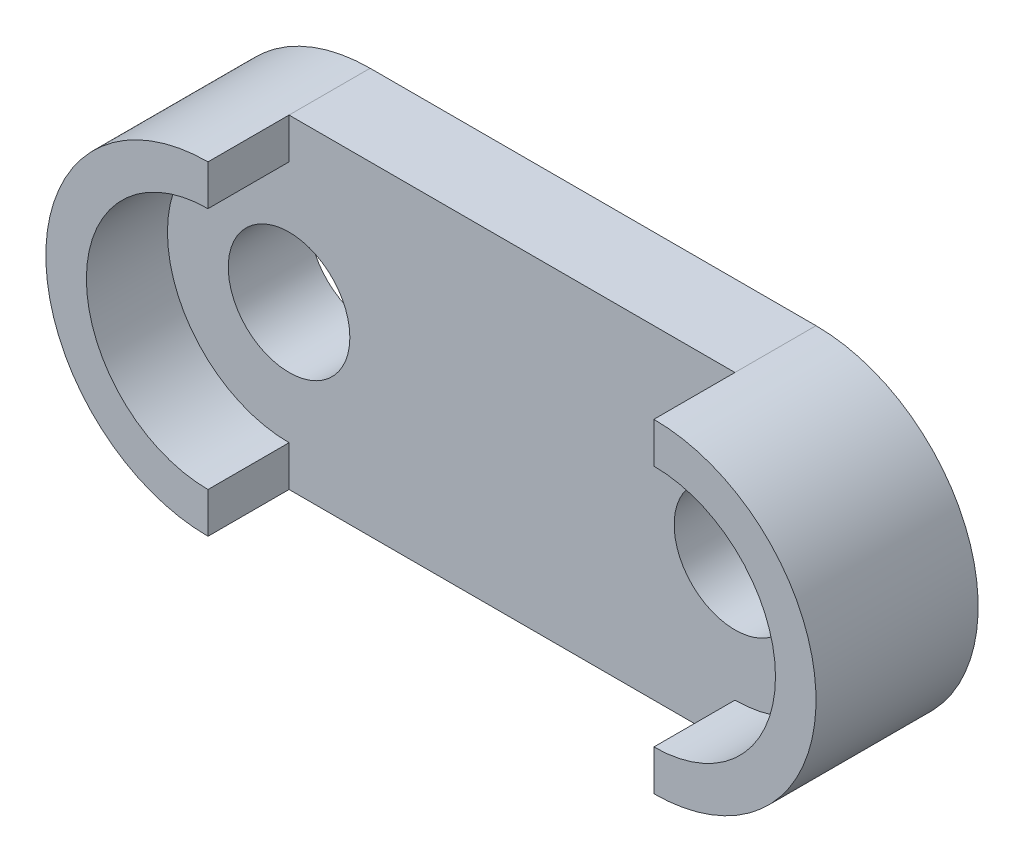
ISO-10303-21;
HEADER;
FILE_DESCRIPTION(('STEP AP214'),'2;1');
FILE_NAME('part.step','',(''),(''),'','','');
FILE_SCHEMA(('AUTOMOTIVE_DESIGN { 1 0 10303 214 1 1 1 1 }'));
ENDSEC;
DATA;
#1=APPLICATION_CONTEXT('core data for automotive mechanical design processes');
#2=APPLICATION_PROTOCOL_DEFINITION('international standard','automotive_design',2000,#1);
#3=PRODUCT_CONTEXT('',#1,'mechanical');
#4=PRODUCT('Part','Part','',(#3));
#5=PRODUCT_RELATED_PRODUCT_CATEGORY('part','',(#4));
#6=PRODUCT_DEFINITION_FORMATION('','',#4);
#7=PRODUCT_DEFINITION_CONTEXT('part definition',#1,'design');
#8=PRODUCT_DEFINITION('design','',#6,#7);
#9=PRODUCT_DEFINITION_SHAPE('','',#8);
#10=(LENGTH_UNIT() NAMED_UNIT(*) SI_UNIT(.MILLI.,.METRE.));
#11=(NAMED_UNIT(*) PLANE_ANGLE_UNIT() SI_UNIT($,.RADIAN.));
#12=(NAMED_UNIT(*) SI_UNIT($,.STERADIAN.) SOLID_ANGLE_UNIT());
#13=UNCERTAINTY_MEASURE_WITH_UNIT(LENGTH_MEASURE(1.E-05),#10,'distance_accuracy_value','');
#14=(GEOMETRIC_REPRESENTATION_CONTEXT(3) GLOBAL_UNCERTAINTY_ASSIGNED_CONTEXT((#13)) GLOBAL_UNIT_ASSIGNED_CONTEXT((#10,
#11,#12)) REPRESENTATION_CONTEXT('',''));
#15=CARTESIAN_POINT('',(0.,0.,0.));
#16=DIRECTION('',(0.,0.,1.));
#17=DIRECTION('',(1.,0.,0.));
#18=AXIS2_PLACEMENT_3D('',#15,#16,#17);
#19=CARTESIAN_POINT('',(-5.50000000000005,0.,1.));
#20=DIRECTION('',(0.,0.,1.));
#21=DIRECTION('',(1.,0.,0.));
#22=AXIS2_PLACEMENT_3D('',#19,#20,#21);
#23=PLANE('',#22);
#24=CARTESIAN_POINT('',(5.50000000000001,0.,0.999999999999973));
#25=DIRECTION('',(0.,0.,1.));
#26=DIRECTION('',(1.,0.,0.));
#27=AXIS2_PLACEMENT_3D('',#24,#25,#26);
#28=CIRCLE('',#27,1.5);
#29=CARTESIAN_POINT('',(7.00000000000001,0.,0.999999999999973));
#30=VERTEX_POINT('',#29);
#31=EDGE_CURVE('E174',#30,#30,#28,.T.);
#32=ORIENTED_EDGE('',*,*,#31,.F.);
#33=EDGE_LOOP('',(#32));
#34=FACE_BOUND('',#33,.T.);
#35=CARTESIAN_POINT('',(-5.50000000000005,0.,1.));
#36=DIRECTION('',(0.,0.,1.));
#37=DIRECTION('',(1.,0.,0.));
#38=AXIS2_PLACEMENT_3D('',#35,#36,#37);
#39=CIRCLE('',#38,1.5);
#40=CARTESIAN_POINT('',(-4.00000000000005,0.,1.));
#41=VERTEX_POINT('',#40);
#42=EDGE_CURVE('E168',#41,#41,#39,.T.);
#43=ORIENTED_EDGE('',*,*,#42,.F.);
#44=EDGE_LOOP('',(#43));
#45=FACE_BOUND('',#44,.T.);
#46=CARTESIAN_POINT('',(-5.50000000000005,0.,1.));
#47=DIRECTION('',(0.,0.,-1.));
#48=DIRECTION('',(-1.,0.,0.));
#49=AXIS2_PLACEMENT_3D('',#46,#47,#48);
#50=CIRCLE('',#49,3.);
#51=CARTESIAN_POINT('',(-5.50000000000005,-3.00000000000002,1.00000000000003));
#52=VERTEX_POINT('',#51);
#53=CARTESIAN_POINT('',(-5.50000000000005,3.,1.));
#54=VERTEX_POINT('',#53);
#55=EDGE_CURVE('E46',#52,#54,#50,.T.);
#56=ORIENTED_EDGE('',*,*,#55,.F.);
#57=DIRECTION('',(0.,1.,0.));
#58=VECTOR('',#57,1.);
#59=CARTESIAN_POINT('',(-5.50000000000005,-4.00000000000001,1.00000000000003));
#60=LINE('',#59,#58);
#61=CARTESIAN_POINT('',(-5.50000000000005,-4.00000000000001,1.00000000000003));
#62=VERTEX_POINT('',#61);
#63=EDGE_CURVE('E124',#62,#52,#60,.T.);
#64=ORIENTED_EDGE('',*,*,#63,.F.);
#65=DIRECTION('',(1.,0.,0.));
#66=VECTOR('',#65,1.);
#67=CARTESIAN_POINT('',(-5.50000000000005,-4.00000000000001,1.00000000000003));
#68=LINE('',#67,#66);
#69=CARTESIAN_POINT('',(5.50000000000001,-4.00000000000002,1.));
#70=VERTEX_POINT('',#69);
#71=EDGE_CURVE('E117',#62,#70,#68,.T.);
#72=ORIENTED_EDGE('',*,*,#71,.T.);
#73=DIRECTION('',(0.,1.,0.));
#74=VECTOR('',#73,1.);
#75=CARTESIAN_POINT('',(5.50000000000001,-4.00000000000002,1.));
#76=LINE('',#75,#74);
#77=CARTESIAN_POINT('',(5.50000000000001,-3.,1.));
#78=VERTEX_POINT('',#77);
#79=EDGE_CURVE('E144',#70,#78,#76,.T.);
#80=ORIENTED_EDGE('',*,*,#79,.T.);
#81=CARTESIAN_POINT('',(5.50000000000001,0.,0.999999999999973));
#82=DIRECTION('',(0.,0.,1.));
#83=DIRECTION('',(1.,0.,0.));
#84=AXIS2_PLACEMENT_3D('',#81,#82,#83);
#85=CIRCLE('',#84,3.);
#86=CARTESIAN_POINT('',(5.50000000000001,3.,0.999999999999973));
#87=VERTEX_POINT('',#86);
#88=EDGE_CURVE('E136',#78,#87,#85,.T.);
#89=ORIENTED_EDGE('',*,*,#88,.T.);
#90=DIRECTION('',(0.,1.,0.));
#91=VECTOR('',#90,1.);
#92=CARTESIAN_POINT('',(5.50000000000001,3.,0.999999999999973));
#93=LINE('',#92,#91);
#94=CARTESIAN_POINT('',(5.50000000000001,4.,0.999999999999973));
#95=VERTEX_POINT('',#94);
#96=EDGE_CURVE('E132',#87,#95,#93,.T.);
#97=ORIENTED_EDGE('',*,*,#96,.T.);
#98=DIRECTION('',(-1.,0.,0.));
#99=VECTOR('',#98,1.);
#100=CARTESIAN_POINT('',(-5.50000000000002,4.,1.));
#101=LINE('',#100,#99);
#102=CARTESIAN_POINT('',(-5.50000000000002,4.,1.));
#103=VERTEX_POINT('',#102);
#104=EDGE_CURVE('E121',#95,#103,#101,.T.);
#105=ORIENTED_EDGE('',*,*,#104,.T.);
#106=DIRECTION('',(0.,1.,0.));
#107=VECTOR('',#106,1.);
#108=CARTESIAN_POINT('',(-5.50000000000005,3.,1.));
#109=LINE('',#108,#107);
#110=EDGE_CURVE('E51',#54,#103,#109,.T.);
#111=ORIENTED_EDGE('',*,*,#110,.F.);
#112=EDGE_LOOP('',(#56,#64,#72,#80,#89,#97,#105,#111));
#113=FACE_BOUND('',#112,.T.);
#114=ADVANCED_FACE('F31',(#34,#45,#113),#23,.T.);
#115=CARTESIAN_POINT('',(-5.50000000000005,0.,-1.));
#116=DIRECTION('',(0.,0.,1.));
#117=DIRECTION('',(1.,0.,0.));
#118=AXIS2_PLACEMENT_3D('',#115,#116,#117);
#119=PLANE('',#118);
#120=CARTESIAN_POINT('',(5.50000000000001,0.,-1.00000000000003));
#121=DIRECTION('',(0.,0.,1.));
#122=DIRECTION('',(1.,0.,0.));
#123=AXIS2_PLACEMENT_3D('',#120,#121,#122);
#124=CIRCLE('',#123,1.5);
#125=CARTESIAN_POINT('',(7.00000000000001,0.,-1.00000000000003));
#126=VERTEX_POINT('',#125);
#127=EDGE_CURVE('E171',#126,#126,#124,.T.);
#128=ORIENTED_EDGE('',*,*,#127,.T.);
#129=EDGE_LOOP('',(#128));
#130=FACE_BOUND('',#129,.T.);
#131=CARTESIAN_POINT('',(-5.50000000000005,0.,-1.));
#132=DIRECTION('',(0.,0.,1.));
#133=DIRECTION('',(1.,0.,0.));
#134=AXIS2_PLACEMENT_3D('',#131,#132,#133);
#135=CIRCLE('',#134,4.);
#136=CARTESIAN_POINT('',(-5.50000000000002,4.,-1.));
#137=VERTEX_POINT('',#136);
#138=CARTESIAN_POINT('',(-5.50000000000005,-4.00000000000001,-0.999999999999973));
#139=VERTEX_POINT('',#138);
#140=EDGE_CURVE('E113',#137,#139,#135,.T.);
#141=ORIENTED_EDGE('',*,*,#140,.F.);
#142=DIRECTION('',(-1.,0.,0.));
#143=VECTOR('',#142,1.);
#144=CARTESIAN_POINT('',(-5.50000000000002,4.,-1.));
#145=LINE('',#144,#143);
#146=CARTESIAN_POINT('',(5.50000000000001,4.,-1.00000000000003));
#147=VERTEX_POINT('',#146);
#148=EDGE_CURVE('E122',#147,#137,#145,.T.);
#149=ORIENTED_EDGE('',*,*,#148,.F.);
#150=CARTESIAN_POINT('',(5.50000000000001,0.,-1.00000000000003));
#151=DIRECTION('',(0.,0.,1.));
#152=DIRECTION('',(-1.,0.,0.));
#153=AXIS2_PLACEMENT_3D('',#150,#151,#152);
#154=CIRCLE('',#153,4.);
#155=CARTESIAN_POINT('',(5.50000000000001,-4.00000000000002,-1.));
#156=VERTEX_POINT('',#155);
#157=EDGE_CURVE('E180',#156,#147,#154,.T.);
#158=ORIENTED_EDGE('',*,*,#157,.F.);
#159=DIRECTION('',(1.,0.,0.));
#160=VECTOR('',#159,1.);
#161=CARTESIAN_POINT('',(-5.50000000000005,-4.00000000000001,-0.999999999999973));
#162=LINE('',#161,#160);
#163=EDGE_CURVE('E178',#139,#156,#162,.T.);
#164=ORIENTED_EDGE('',*,*,#163,.F.);
#165=EDGE_LOOP('',(#141,#149,#158,#164));
#166=FACE_BOUND('',#165,.T.);
#167=CARTESIAN_POINT('',(-5.50000000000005,0.,-1.));
#168=DIRECTION('',(0.,0.,1.));
#169=DIRECTION('',(1.,0.,0.));
#170=AXIS2_PLACEMENT_3D('',#167,#168,#169);
#171=CIRCLE('',#170,1.5);
#172=CARTESIAN_POINT('',(-4.00000000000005,0.,-1.));
#173=VERTEX_POINT('',#172);
#174=EDGE_CURVE('E165',#173,#173,#171,.T.);
#175=ORIENTED_EDGE('',*,*,#174,.T.);
#176=EDGE_LOOP('',(#175));
#177=FACE_BOUND('',#176,.T.);
#178=ADVANCED_FACE('F196',(#130,#166,#177),#119,.F.);
#179=CARTESIAN_POINT('',(-5.50000000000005,0.,1.));
#180=DIRECTION('',(0.,0.,-1.));
#181=DIRECTION('',(-1.,0.,0.));
#182=AXIS2_PLACEMENT_3D('',#179,#180,#181);
#183=CYLINDRICAL_SURFACE('',#182,4.);
#184=ORIENTED_EDGE('',*,*,#140,.T.);
#185=DIRECTION('',(0.,0.,-1.));
#186=VECTOR('',#185,1.);
#187=CARTESIAN_POINT('',(-5.50000000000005,-4.00000000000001,1.00000000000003));
#188=LINE('',#187,#186);
#189=EDGE_CURVE('E11',#62,#139,#188,.T.);
#190=ORIENTED_EDGE('',*,*,#189,.F.);
#191=DIRECTION('',(0.,0.,-1.));
#192=VECTOR('',#191,1.);
#193=CARTESIAN_POINT('',(-5.50000000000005,-4.00000000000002,3.00000000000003));
#194=LINE('',#193,#192);
#195=CARTESIAN_POINT('',(-5.50000000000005,-4.00000000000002,3.00000000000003));
#196=VERTEX_POINT('',#195);
#197=EDGE_CURVE('E109',#196,#62,#194,.T.);
#198=ORIENTED_EDGE('',*,*,#197,.F.);
#199=CARTESIAN_POINT('',(-5.50000000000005,0.,3.));
#200=DIRECTION('',(0.,0.,-1.));
#201=DIRECTION('',(-1.,0.,0.));
#202=AXIS2_PLACEMENT_3D('',#199,#200,#201);
#203=CIRCLE('',#202,4.);
#204=CARTESIAN_POINT('',(-5.50000000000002,4.,3.));
#205=VERTEX_POINT('',#204);
#206=EDGE_CURVE('E205',#196,#205,#203,.T.);
#207=ORIENTED_EDGE('',*,*,#206,.T.);
#208=DIRECTION('',(0.,0.,-1.));
#209=VECTOR('',#208,1.);
#210=CARTESIAN_POINT('',(-5.50000000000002,4.,3.));
#211=LINE('',#210,#209);
#212=EDGE_CURVE('E204',#205,#103,#211,.T.);
#213=ORIENTED_EDGE('',*,*,#212,.T.);
#214=DIRECTION('',(0.,0.,-1.));
#215=VECTOR('',#214,1.);
#216=CARTESIAN_POINT('',(-5.50000000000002,4.,1.));
#217=LINE('',#216,#215);
#218=EDGE_CURVE('E184',#103,#137,#217,.T.);
#219=ORIENTED_EDGE('',*,*,#218,.T.);
#220=EDGE_LOOP('',(#184,#190,#198,#207,#213,#219));
#221=FACE_BOUND('',#220,.T.);
#222=ADVANCED_FACE('F33',(#221),#183,.T.);
#223=CARTESIAN_POINT('',(-5.50000000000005,-4.00000000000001,1.00000000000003));
#224=DIRECTION('',(0.,1.,0.));
#225=DIRECTION('',(0.,0.,1.));
#226=AXIS2_PLACEMENT_3D('',#223,#224,#225);
#227=PLANE('',#226);
#228=ORIENTED_EDGE('',*,*,#163,.T.);
#229=DIRECTION('',(0.,0.,-1.));
#230=VECTOR('',#229,1.);
#231=CARTESIAN_POINT('',(5.50000000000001,-4.00000000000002,1.));
#232=LINE('',#231,#230);
#233=EDGE_CURVE('E39',#70,#156,#232,.T.);
#234=ORIENTED_EDGE('',*,*,#233,.F.);
#235=ORIENTED_EDGE('',*,*,#71,.F.);
#236=ORIENTED_EDGE('',*,*,#189,.T.);
#237=EDGE_LOOP('',(#228,#234,#235,#236));
#238=FACE_BOUND('',#237,.T.);
#239=ADVANCED_FACE('F118',(#238),#227,.F.);
#240=CARTESIAN_POINT('',(5.50000000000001,0.,0.999999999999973));
#241=DIRECTION('',(0.,0.,-1.));
#242=DIRECTION('',(-1.,0.,0.));
#243=AXIS2_PLACEMENT_3D('',#240,#241,#242);
#244=CYLINDRICAL_SURFACE('',#243,4.);
#245=ORIENTED_EDGE('',*,*,#157,.T.);
#246=DIRECTION('',(0.,0.,-1.));
#247=VECTOR('',#246,1.);
#248=CARTESIAN_POINT('',(5.50000000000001,4.,0.999999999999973));
#249=LINE('',#248,#247);
#250=EDGE_CURVE('E186',#95,#147,#249,.T.);
#251=ORIENTED_EDGE('',*,*,#250,.F.);
#252=DIRECTION('',(0.,0.,-1.));
#253=VECTOR('',#252,1.);
#254=CARTESIAN_POINT('',(5.50000000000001,4.,2.99999999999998));
#255=LINE('',#254,#253);
#256=CARTESIAN_POINT('',(5.50000000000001,4.,2.99999999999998));
#257=VERTEX_POINT('',#256);
#258=EDGE_CURVE('E163',#257,#95,#255,.T.);
#259=ORIENTED_EDGE('',*,*,#258,.F.);
#260=CARTESIAN_POINT('',(5.50000000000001,0.,2.99999999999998));
#261=DIRECTION('',(0.,0.,1.));
#262=DIRECTION('',(1.,0.,0.));
#263=AXIS2_PLACEMENT_3D('',#260,#261,#262);
#264=CIRCLE('',#263,4.);
#265=CARTESIAN_POINT('',(5.50000000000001,-4.,3.));
#266=VERTEX_POINT('',#265);
#267=EDGE_CURVE('E146',#266,#257,#264,.T.);
#268=ORIENTED_EDGE('',*,*,#267,.F.);
#269=DIRECTION('',(0.,0.,-1.));
#270=VECTOR('',#269,1.);
#271=CARTESIAN_POINT('',(5.50000000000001,-4.,3.));
#272=LINE('',#271,#270);
#273=EDGE_CURVE('E157',#266,#70,#272,.T.);
#274=ORIENTED_EDGE('',*,*,#273,.T.);
#275=ORIENTED_EDGE('',*,*,#233,.T.);
#276=EDGE_LOOP('',(#245,#251,#259,#268,#274,#275));
#277=FACE_BOUND('',#276,.T.);
#278=ADVANCED_FACE('F190',(#277),#244,.T.);
#279=CARTESIAN_POINT('',(-5.50000000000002,4.,1.));
#280=DIRECTION('',(0.,-1.,0.));
#281=DIRECTION('',(0.,0.,-1.));
#282=AXIS2_PLACEMENT_3D('',#279,#280,#281);
#283=PLANE('',#282);
#284=ORIENTED_EDGE('',*,*,#148,.T.);
#285=ORIENTED_EDGE('',*,*,#218,.F.);
#286=ORIENTED_EDGE('',*,*,#104,.F.);
#287=ORIENTED_EDGE('',*,*,#250,.T.);
#288=EDGE_LOOP('',(#284,#285,#286,#287));
#289=FACE_BOUND('',#288,.T.);
#290=ADVANCED_FACE('F200',(#289),#283,.F.);
#291=CARTESIAN_POINT('',(5.50000000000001,0.,0.999999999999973));
#292=DIRECTION('',(0.,0.,-1.));
#293=DIRECTION('',(-1.,0.,0.));
#294=AXIS2_PLACEMENT_3D('',#291,#292,#293);
#295=CYLINDRICAL_SURFACE('',#294,1.5);
#296=ORIENTED_EDGE('',*,*,#31,.T.);
#297=EDGE_LOOP('',(#296));
#298=FACE_BOUND('',#297,.T.);
#299=ORIENTED_EDGE('',*,*,#127,.F.);
#300=EDGE_LOOP('',(#299));
#301=FACE_BOUND('',#300,.T.);
#302=ADVANCED_FACE('F248',(#298,#301),#295,.F.);
#303=CARTESIAN_POINT('',(-5.50000000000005,0.,1.));
#304=DIRECTION('',(0.,0.,-1.));
#305=DIRECTION('',(-1.,0.,0.));
#306=AXIS2_PLACEMENT_3D('',#303,#304,#305);
#307=CYLINDRICAL_SURFACE('',#306,1.5);
#308=ORIENTED_EDGE('',*,*,#42,.T.);
#309=EDGE_LOOP('',(#308));
#310=FACE_BOUND('',#309,.T.);
#311=ORIENTED_EDGE('',*,*,#174,.F.);
#312=EDGE_LOOP('',(#311));
#313=FACE_BOUND('',#312,.T.);
#314=ADVANCED_FACE('F333',(#310,#313),#307,.F.);
#315=CARTESIAN_POINT('',(5.50000000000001,3.,2.99999999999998));
#316=DIRECTION('',(-1.,0.,0.));
#317=DIRECTION('',(0.,0.,1.));
#318=AXIS2_PLACEMENT_3D('',#315,#316,#317);
#319=PLANE('',#318);
#320=ORIENTED_EDGE('',*,*,#96,.F.);
#321=DIRECTION('',(0.,0.,-1.));
#322=VECTOR('',#321,1.);
#323=CARTESIAN_POINT('',(5.50000000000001,3.,2.99999999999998));
#324=LINE('',#323,#322);
#325=CARTESIAN_POINT('',(5.50000000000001,3.,2.99999999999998));
#326=VERTEX_POINT('',#325);
#327=EDGE_CURVE('E161',#326,#87,#324,.T.);
#328=ORIENTED_EDGE('',*,*,#327,.F.);
#329=DIRECTION('',(0.,1.,0.));
#330=VECTOR('',#329,1.);
#331=CARTESIAN_POINT('',(5.50000000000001,3.,2.99999999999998));
#332=LINE('',#331,#330);
#333=EDGE_CURVE('E148',#326,#257,#332,.T.);
#334=ORIENTED_EDGE('',*,*,#333,.T.);
#335=ORIENTED_EDGE('',*,*,#258,.T.);
#336=EDGE_LOOP('',(#320,#328,#334,#335));
#337=FACE_BOUND('',#336,.T.);
#338=ADVANCED_FACE('F323',(#337),#319,.T.);
#339=CARTESIAN_POINT('',(5.50000000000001,0.,2.99999999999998));
#340=DIRECTION('',(0.,0.,-1.));
#341=DIRECTION('',(-1.,0.,0.));
#342=AXIS2_PLACEMENT_3D('',#339,#340,#341);
#343=CYLINDRICAL_SURFACE('',#342,3.);
#344=ORIENTED_EDGE('',*,*,#88,.F.);
#345=DIRECTION('',(0.,0.,-1.));
#346=VECTOR('',#345,1.);
#347=CARTESIAN_POINT('',(5.50000000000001,-3.,3.));
#348=LINE('',#347,#346);
#349=CARTESIAN_POINT('',(5.50000000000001,-3.,3.));
#350=VERTEX_POINT('',#349);
#351=EDGE_CURVE('E159',#350,#78,#348,.T.);
#352=ORIENTED_EDGE('',*,*,#351,.F.);
#353=CARTESIAN_POINT('',(5.50000000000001,0.,2.99999999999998));
#354=DIRECTION('',(0.,0.,1.));
#355=DIRECTION('',(1.,0.,0.));
#356=AXIS2_PLACEMENT_3D('',#353,#354,#355);
#357=CIRCLE('',#356,3.);
#358=EDGE_CURVE('E151',#350,#326,#357,.T.);
#359=ORIENTED_EDGE('',*,*,#358,.T.);
#360=ORIENTED_EDGE('',*,*,#327,.T.);
#361=EDGE_LOOP('',(#344,#352,#359,#360));
#362=FACE_BOUND('',#361,.T.);
#363=ADVANCED_FACE('F313',(#362),#343,.F.);
#364=CARTESIAN_POINT('',(5.50000000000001,-4.,3.));
#365=DIRECTION('',(-1.,0.,0.));
#366=DIRECTION('',(0.,-1.,0.));
#367=AXIS2_PLACEMENT_3D('',#364,#365,#366);
#368=PLANE('',#367);
#369=ORIENTED_EDGE('',*,*,#79,.F.);
#370=ORIENTED_EDGE('',*,*,#273,.F.);
#371=DIRECTION('',(0.,1.,0.));
#372=VECTOR('',#371,1.);
#373=CARTESIAN_POINT('',(5.50000000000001,-4.,3.));
#374=LINE('',#373,#372);
#375=EDGE_CURVE('E154',#266,#350,#374,.T.);
#376=ORIENTED_EDGE('',*,*,#375,.T.);
#377=ORIENTED_EDGE('',*,*,#351,.T.);
#378=EDGE_LOOP('',(#369,#370,#376,#377));
#379=FACE_BOUND('',#378,.T.);
#380=ADVANCED_FACE('F306',(#379),#368,.T.);
#381=CARTESIAN_POINT('',(5.50000000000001,0.,2.99999999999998));
#382=DIRECTION('',(0.,0.,1.));
#383=DIRECTION('',(1.,0.,0.));
#384=AXIS2_PLACEMENT_3D('',#381,#382,#383);
#385=PLANE('',#384);
#386=ORIENTED_EDGE('',*,*,#267,.T.);
#387=ORIENTED_EDGE('',*,*,#333,.F.);
#388=ORIENTED_EDGE('',*,*,#358,.F.);
#389=ORIENTED_EDGE('',*,*,#375,.F.);
#390=EDGE_LOOP('',(#386,#387,#388,#389));
#391=FACE_BOUND('',#390,.T.);
#392=ADVANCED_FACE('F232',(#391),#385,.T.);
#393=CARTESIAN_POINT('',(-5.50000000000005,-4.00000000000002,3.00000000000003));
#394=DIRECTION('',(-1.,0.,0.));
#395=DIRECTION('',(0.,-1.,0.));
#396=AXIS2_PLACEMENT_3D('',#393,#394,#395);
#397=PLANE('',#396);
#398=ORIENTED_EDGE('',*,*,#63,.T.);
#399=DIRECTION('',(0.,0.,-1.));
#400=VECTOR('',#399,1.);
#401=CARTESIAN_POINT('',(-5.50000000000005,-3.00000000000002,3.00000000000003));
#402=LINE('',#401,#400);
#403=CARTESIAN_POINT('',(-5.50000000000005,-3.00000000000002,3.00000000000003));
#404=VERTEX_POINT('',#403);
#405=EDGE_CURVE('E133',#404,#52,#402,.T.);
#406=ORIENTED_EDGE('',*,*,#405,.F.);
#407=DIRECTION('',(0.,1.,0.));
#408=VECTOR('',#407,1.);
#409=CARTESIAN_POINT('',(-5.50000000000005,-4.00000000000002,3.00000000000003));
#410=LINE('',#409,#408);
#411=EDGE_CURVE('E130',#196,#404,#410,.T.);
#412=ORIENTED_EDGE('',*,*,#411,.F.);
#413=ORIENTED_EDGE('',*,*,#197,.T.);
#414=EDGE_LOOP('',(#398,#406,#412,#413));
#415=FACE_BOUND('',#414,.T.);
#416=ADVANCED_FACE('F129',(#415),#397,.F.);
#417=CARTESIAN_POINT('',(-5.50000000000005,0.,3.));
#418=DIRECTION('',(0.,0.,-1.));
#419=DIRECTION('',(-1.,0.,0.));
#420=AXIS2_PLACEMENT_3D('',#417,#418,#419);
#421=CYLINDRICAL_SURFACE('',#420,3.);
#422=ORIENTED_EDGE('',*,*,#55,.T.);
#423=DIRECTION('',(0.,0.,-1.));
#424=VECTOR('',#423,1.);
#425=CARTESIAN_POINT('',(-5.50000000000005,3.,3.));
#426=LINE('',#425,#424);
#427=CARTESIAN_POINT('',(-5.50000000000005,3.,3.));
#428=VERTEX_POINT('',#427);
#429=EDGE_CURVE('E138',#428,#54,#426,.T.);
#430=ORIENTED_EDGE('',*,*,#429,.F.);
#431=CARTESIAN_POINT('',(-5.50000000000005,0.,3.));
#432=DIRECTION('',(0.,0.,-1.));
#433=DIRECTION('',(-1.,0.,0.));
#434=AXIS2_PLACEMENT_3D('',#431,#432,#433);
#435=CIRCLE('',#434,3.);
#436=EDGE_CURVE('E218',#404,#428,#435,.T.);
#437=ORIENTED_EDGE('',*,*,#436,.F.);
#438=ORIENTED_EDGE('',*,*,#405,.T.);
#439=EDGE_LOOP('',(#422,#430,#437,#438));
#440=FACE_BOUND('',#439,.T.);
#441=ADVANCED_FACE('F224',(#440),#421,.F.);
#442=CARTESIAN_POINT('',(-5.50000000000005,3.,3.));
#443=DIRECTION('',(-1.,0.,0.));
#444=DIRECTION('',(0.,0.,1.));
#445=AXIS2_PLACEMENT_3D('',#442,#443,#444);
#446=PLANE('',#445);
#447=ORIENTED_EDGE('',*,*,#110,.T.);
#448=ORIENTED_EDGE('',*,*,#212,.F.);
#449=DIRECTION('',(0.,1.,0.));
#450=VECTOR('',#449,1.);
#451=CARTESIAN_POINT('',(-5.50000000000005,3.,3.));
#452=LINE('',#451,#450);
#453=EDGE_CURVE('E208',#428,#205,#452,.T.);
#454=ORIENTED_EDGE('',*,*,#453,.F.);
#455=ORIENTED_EDGE('',*,*,#429,.T.);
#456=EDGE_LOOP('',(#447,#448,#454,#455));
#457=FACE_BOUND('',#456,.T.);
#458=ADVANCED_FACE('F211',(#457),#446,.F.);
#459=CARTESIAN_POINT('',(-5.50000000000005,0.,3.));
#460=DIRECTION('',(0.,0.,-1.));
#461=DIRECTION('',(-1.,0.,0.));
#462=AXIS2_PLACEMENT_3D('',#459,#460,#461);
#463=PLANE('',#462);
#464=ORIENTED_EDGE('',*,*,#206,.F.);
#465=ORIENTED_EDGE('',*,*,#411,.T.);
#466=ORIENTED_EDGE('',*,*,#436,.T.);
#467=ORIENTED_EDGE('',*,*,#453,.T.);
#468=EDGE_LOOP('',(#464,#465,#466,#467));
#469=FACE_BOUND('',#468,.T.);
#470=ADVANCED_FACE('F221',(#469),#463,.F.);
#471=CLOSED_SHELL('',(#114,#178,#222,#239,#278,#290,#302,#314,#338,#363,#380,#392,#416,#441,
#458,#470));
#472=MANIFOLD_SOLID_BREP('B2',#471);
#473=ADVANCED_BREP_SHAPE_REPRESENTATION('',(#18,#472),#14);
#474=SHAPE_DEFINITION_REPRESENTATION(#9,#473);
ENDSEC;
END-ISO-10303-21;
